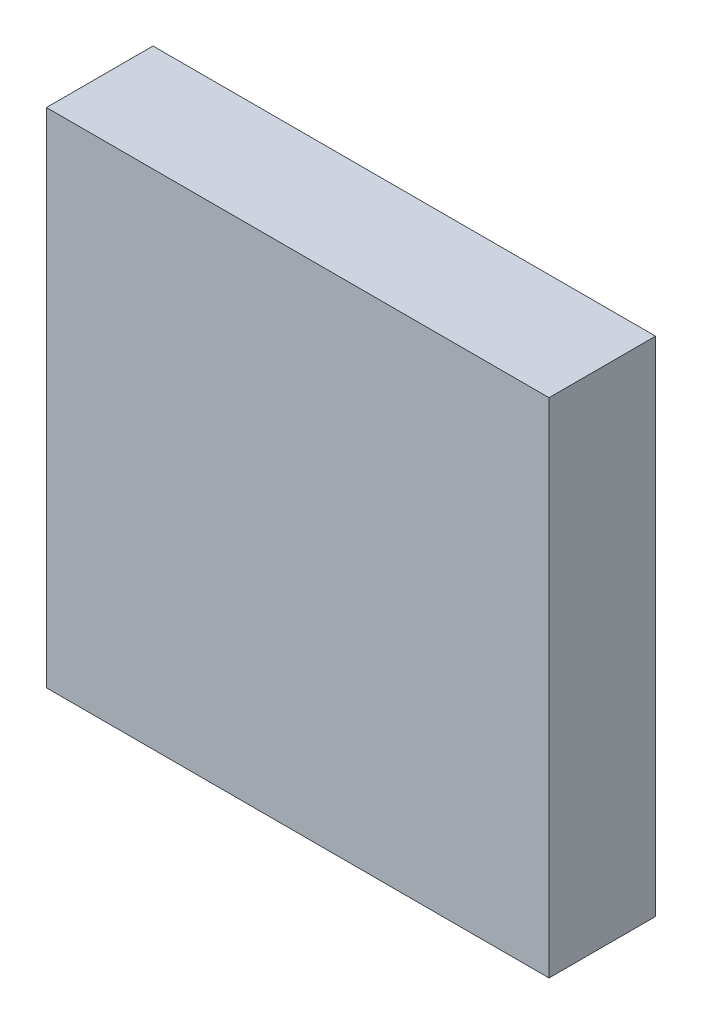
ISO-10303-21;
HEADER;
FILE_DESCRIPTION(('STEP AP214'),'2;1');
FILE_NAME('part.step','',(''),(''),'','','');
FILE_SCHEMA(('AUTOMOTIVE_DESIGN { 1 0 10303 214 1 1 1 1 }'));
ENDSEC;
DATA;
#1=APPLICATION_CONTEXT('core data for automotive mechanical design processes');
#2=APPLICATION_PROTOCOL_DEFINITION('international standard','automotive_design',2000,#1);
#3=PRODUCT_CONTEXT('',#1,'mechanical');
#4=PRODUCT('Part','Part','',(#3));
#5=PRODUCT_RELATED_PRODUCT_CATEGORY('part','',(#4));
#6=PRODUCT_DEFINITION_FORMATION('','',#4);
#7=PRODUCT_DEFINITION_CONTEXT('part definition',#1,'design');
#8=PRODUCT_DEFINITION('design','',#6,#7);
#9=PRODUCT_DEFINITION_SHAPE('','',#8);
#10=(LENGTH_UNIT() NAMED_UNIT(*) SI_UNIT(.MILLI.,.METRE.));
#11=(NAMED_UNIT(*) PLANE_ANGLE_UNIT() SI_UNIT($,.RADIAN.));
#12=(NAMED_UNIT(*) SI_UNIT($,.STERADIAN.) SOLID_ANGLE_UNIT());
#13=UNCERTAINTY_MEASURE_WITH_UNIT(LENGTH_MEASURE(1.E-05),#10,'distance_accuracy_value','');
#14=(GEOMETRIC_REPRESENTATION_CONTEXT(3) GLOBAL_UNCERTAINTY_ASSIGNED_CONTEXT((#13)) GLOBAL_UNIT_ASSIGNED_CONTEXT((#10,
#11,#12)) REPRESENTATION_CONTEXT('',''));
#15=CARTESIAN_POINT('',(0.,0.,0.));
#16=DIRECTION('',(0.,0.,1.));
#17=DIRECTION('',(1.,0.,0.));
#18=AXIS2_PLACEMENT_3D('',#15,#16,#17);
#19=CARTESIAN_POINT('',(0.,0.,0.70000114));
#20=DIRECTION('',(0.,0.,1.));
#21=DIRECTION('',(1.,0.,0.));
#22=AXIS2_PLACEMENT_3D('',#19,#20,#21);
#23=PLANE('',#22);
#24=DIRECTION('',(0.,-1.,0.));
#25=VECTOR('',#24,1.);
#26=CARTESIAN_POINT('',(-1.651,1.651,0.70000114));
#27=LINE('',#26,#25);
#28=CARTESIAN_POINT('',(-1.651,1.651,0.70000114));
#29=VERTEX_POINT('',#28);
#30=CARTESIAN_POINT('',(-1.651,-1.651,0.70000114));
#31=VERTEX_POINT('',#30);
#32=EDGE_CURVE('E83',#29,#31,#27,.T.);
#33=ORIENTED_EDGE('',*,*,#32,.T.);
#34=DIRECTION('',(1.,0.,0.));
#35=VECTOR('',#34,1.);
#36=CARTESIAN_POINT('',(-1.651,-1.651,0.70000114));
#37=LINE('',#36,#35);
#38=CARTESIAN_POINT('',(1.651,-1.651,0.70000114));
#39=VERTEX_POINT('',#38);
#40=EDGE_CURVE('E107',#31,#39,#37,.T.);
#41=ORIENTED_EDGE('',*,*,#40,.T.);
#42=DIRECTION('',(0.,1.,0.));
#43=VECTOR('',#42,1.);
#44=CARTESIAN_POINT('',(1.651,-1.651,0.70000114));
#45=LINE('',#44,#43);
#46=CARTESIAN_POINT('',(1.651,1.651,0.70000114));
#47=VERTEX_POINT('',#46);
#48=EDGE_CURVE('E20',#39,#47,#45,.T.);
#49=ORIENTED_EDGE('',*,*,#48,.T.);
#50=DIRECTION('',(-1.,0.,0.));
#51=VECTOR('',#50,1.);
#52=CARTESIAN_POINT('',(1.651,1.651,0.70000114));
#53=LINE('',#52,#51);
#54=EDGE_CURVE('E11',#47,#29,#53,.T.);
#55=ORIENTED_EDGE('',*,*,#54,.T.);
#56=EDGE_LOOP('',(#33,#41,#49,#55));
#57=FACE_BOUND('',#56,.T.);
#58=ADVANCED_FACE('F17',(#57),#23,.T.);
#59=CARTESIAN_POINT('',(0.,0.,0.));
#60=DIRECTION('',(0.,0.,1.));
#61=DIRECTION('',(1.,0.,0.));
#62=AXIS2_PLACEMENT_3D('',#59,#60,#61);
#63=PLANE('',#62);
#64=DIRECTION('',(-1.,0.,0.));
#65=VECTOR('',#64,1.);
#66=CARTESIAN_POINT('',(1.651,1.651,0.));
#67=LINE('',#66,#65);
#68=CARTESIAN_POINT('',(1.651,1.651,0.));
#69=VERTEX_POINT('',#68);
#70=CARTESIAN_POINT('',(-1.651,1.651,0.));
#71=VERTEX_POINT('',#70);
#72=EDGE_CURVE('E26',#69,#71,#67,.T.);
#73=ORIENTED_EDGE('',*,*,#72,.F.);
#74=DIRECTION('',(0.,1.,0.));
#75=VECTOR('',#74,1.);
#76=CARTESIAN_POINT('',(1.651,-1.651,0.));
#77=LINE('',#76,#75);
#78=CARTESIAN_POINT('',(1.651,-1.651,0.));
#79=VERTEX_POINT('',#78);
#80=EDGE_CURVE('E111',#79,#69,#77,.T.);
#81=ORIENTED_EDGE('',*,*,#80,.F.);
#82=DIRECTION('',(1.,0.,0.));
#83=VECTOR('',#82,1.);
#84=CARTESIAN_POINT('',(-1.651,-1.651,0.));
#85=LINE('',#84,#83);
#86=CARTESIAN_POINT('',(-1.651,-1.651,0.));
#87=VERTEX_POINT('',#86);
#88=EDGE_CURVE('E85',#87,#79,#85,.T.);
#89=ORIENTED_EDGE('',*,*,#88,.F.);
#90=DIRECTION('',(0.,-1.,0.));
#91=VECTOR('',#90,1.);
#92=CARTESIAN_POINT('',(-1.651,1.651,0.));
#93=LINE('',#92,#91);
#94=EDGE_CURVE('E81',#71,#87,#93,.T.);
#95=ORIENTED_EDGE('',*,*,#94,.F.);
#96=EDGE_LOOP('',(#73,#81,#89,#95));
#97=FACE_BOUND('',#96,.T.);
#98=ADVANCED_FACE('F87',(#97),#63,.F.);
#99=CARTESIAN_POINT('',(1.651,1.651,0.));
#100=DIRECTION('',(0.,-1.,0.));
#101=DIRECTION('',(0.,0.,-1.));
#102=AXIS2_PLACEMENT_3D('',#99,#100,#101);
#103=PLANE('',#102);
#104=ORIENTED_EDGE('',*,*,#72,.T.);
#105=DIRECTION('',(0.,0.,1.));
#106=VECTOR('',#105,1.);
#107=CARTESIAN_POINT('',(-1.651,1.651,0.));
#108=LINE('',#107,#106);
#109=EDGE_CURVE('E70',#71,#29,#108,.T.);
#110=ORIENTED_EDGE('',*,*,#109,.T.);
#111=ORIENTED_EDGE('',*,*,#54,.F.);
#112=DIRECTION('',(0.,0.,1.));
#113=VECTOR('',#112,1.);
#114=CARTESIAN_POINT('',(1.651,1.651,0.));
#115=LINE('',#114,#113);
#116=EDGE_CURVE('E73',#69,#47,#115,.T.);
#117=ORIENTED_EDGE('',*,*,#116,.F.);
#118=EDGE_LOOP('',(#104,#110,#111,#117));
#119=FACE_BOUND('',#118,.T.);
#120=ADVANCED_FACE('F69',(#119),#103,.F.);
#121=CARTESIAN_POINT('',(1.651,-1.651,0.));
#122=DIRECTION('',(-1.,0.,0.));
#123=DIRECTION('',(0.,0.,1.));
#124=AXIS2_PLACEMENT_3D('',#121,#122,#123);
#125=PLANE('',#124);
#126=ORIENTED_EDGE('',*,*,#80,.T.);
#127=ORIENTED_EDGE('',*,*,#116,.T.);
#128=ORIENTED_EDGE('',*,*,#48,.F.);
#129=DIRECTION('',(0.,0.,1.));
#130=VECTOR('',#129,1.);
#131=CARTESIAN_POINT('',(1.651,-1.651,0.));
#132=LINE('',#131,#130);
#133=EDGE_CURVE('E102',#79,#39,#132,.T.);
#134=ORIENTED_EDGE('',*,*,#133,.F.);
#135=EDGE_LOOP('',(#126,#127,#128,#134));
#136=FACE_BOUND('',#135,.T.);
#137=ADVANCED_FACE('F122',(#136),#125,.F.);
#138=CARTESIAN_POINT('',(-1.651,-1.651,0.));
#139=DIRECTION('',(0.,1.,0.));
#140=DIRECTION('',(1.,0.,0.));
#141=AXIS2_PLACEMENT_3D('',#138,#139,#140);
#142=PLANE('',#141);
#143=ORIENTED_EDGE('',*,*,#88,.T.);
#144=ORIENTED_EDGE('',*,*,#133,.T.);
#145=ORIENTED_EDGE('',*,*,#40,.F.);
#146=DIRECTION('',(0.,0.,1.));
#147=VECTOR('',#146,1.);
#148=CARTESIAN_POINT('',(-1.651,-1.651,0.));
#149=LINE('',#148,#147);
#150=EDGE_CURVE('E91',#87,#31,#149,.T.);
#151=ORIENTED_EDGE('',*,*,#150,.F.);
#152=EDGE_LOOP('',(#143,#144,#145,#151));
#153=FACE_BOUND('',#152,.T.);
#154=ADVANCED_FACE('F124',(#153),#142,.F.);
#155=CARTESIAN_POINT('',(-1.651,1.651,0.));
#156=DIRECTION('',(1.,0.,0.));
#157=DIRECTION('',(0.,1.,0.));
#158=AXIS2_PLACEMENT_3D('',#155,#156,#157);
#159=PLANE('',#158);
#160=ORIENTED_EDGE('',*,*,#94,.T.);
#161=ORIENTED_EDGE('',*,*,#150,.T.);
#162=ORIENTED_EDGE('',*,*,#32,.F.);
#163=ORIENTED_EDGE('',*,*,#109,.F.);
#164=EDGE_LOOP('',(#160,#161,#162,#163));
#165=FACE_BOUND('',#164,.T.);
#166=ADVANCED_FACE('F79',(#165),#159,.F.);
#167=CLOSED_SHELL('',(#58,#98,#120,#137,#154,#166));
#168=MANIFOLD_SOLID_BREP('B1',#167);
#169=ADVANCED_BREP_SHAPE_REPRESENTATION('',(#18,#168),#14);
#170=SHAPE_DEFINITION_REPRESENTATION(#9,#169);
ENDSEC;
END-ISO-10303-21;
